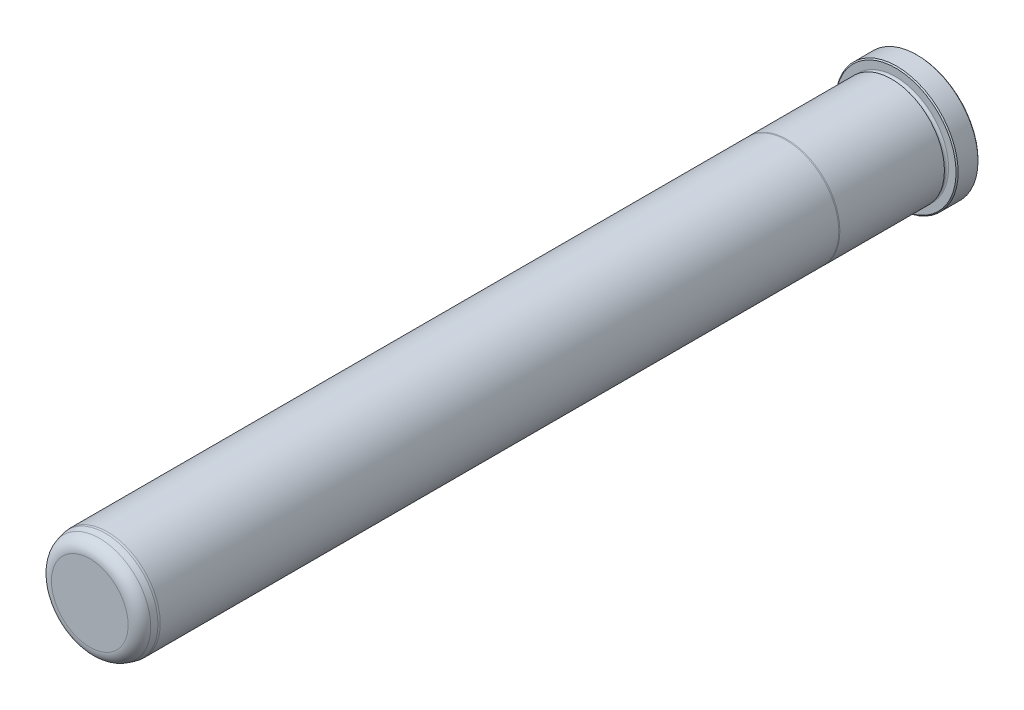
from build123d import *

# Parameters (mm, degrees)
FILLET6_R     = 4.7625
CHAMFER1_SIZE = 0.381


with BuildPart() as part:
    # Sketch1 → Revolve1 (revolve)
    with BuildSketch(Plane(origin=(0, 0, 0), x_dir=(0, 0, -1), z_dir=(1, 0, 0)), mode=Mode.PRIVATE) as revolve1_sk:
        with BuildLine():
            Line((0, 0), (0, 22.098))
            Line((0, 22.098), (-7.9248, 22.098))
            Line((-7.9248, 22.098), (-7.9248, 19.0373))
            ThreePointArc((-7.9248, 19.0373), (-8.6868, 18.2753), (-9.4488, 19.0373))
            Line((-9.4488, 19.0373), (-9.4488, 19.0627))
            Line((-9.4488, 19.0627), (-47.134763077, 19.0627))
            Line((-47.134763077, 19.0627), (-47.498, 19.0373))
            Line((-47.498, 19.0373), (-292.1, 19.0373))
            Line((-292.1, 19.0373), (-292.862, 18.970633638))
            Line((-292.862, 18.970633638), (-298.45, 17.473333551))
            Line((-298.45, 17.473333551), (-298.45, 0))
            Line((-298.45, 0), (0, 0))
        make_face()
    revolve(revolve1_sk.sketch.rotate(Axis((0, 0, 0), (0, 0, -1)), 90), axis=Axis((0, 0, 0), (0, 0, -1)))

    # Fillet6
    fillet6_edges = [part.edges().sort_by_distance(p)[0] for p in [
        (-17.473333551, 0, 298.45),
    ]]
    fillet(fillet6_edges, radius=FILLET6_R)

    # Chamfer1
    chamfer1_edges = [part.edges().sort_by_distance(p)[0] for p in [
        (-22.098, 0, 7.9248),
        (-22.098, 0, 0),
    ]]
    chamfer(chamfer1_edges, length=CHAMFER1_SIZE)


solid = part.part
